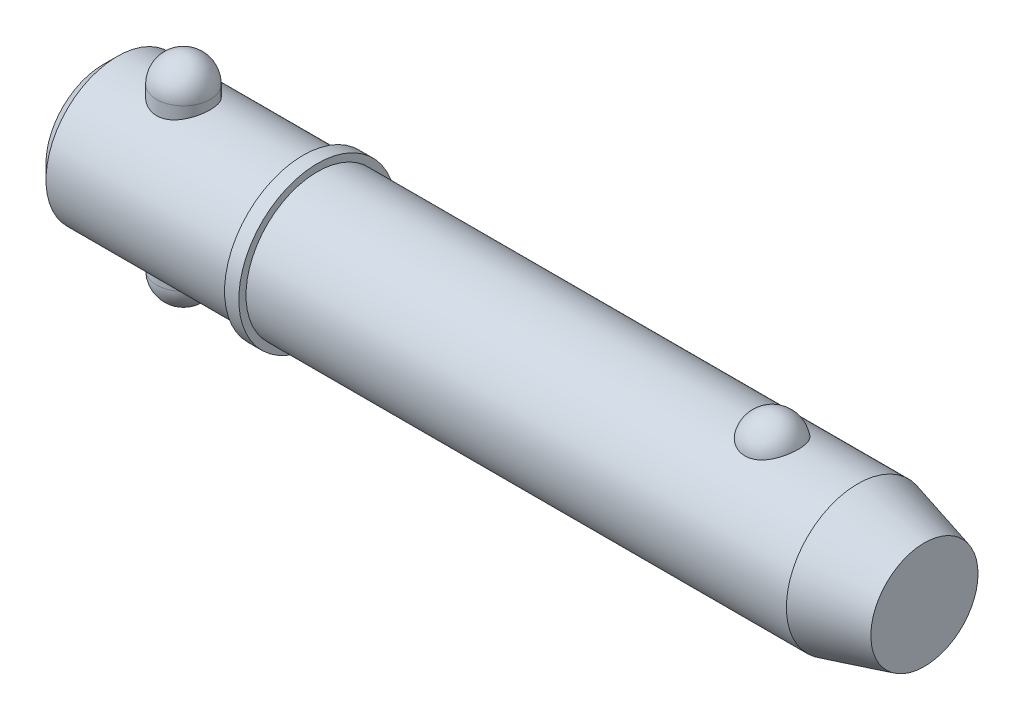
ISO-10303-21;
HEADER;
FILE_DESCRIPTION(('STEP AP214'),'2;1');
FILE_NAME('part.step','',(''),(''),'','','');
FILE_SCHEMA(('AUTOMOTIVE_DESIGN { 1 0 10303 214 1 1 1 1 }'));
ENDSEC;
DATA;
#1=APPLICATION_CONTEXT('core data for automotive mechanical design processes');
#2=APPLICATION_PROTOCOL_DEFINITION('international standard','automotive_design',2000,#1);
#3=PRODUCT_CONTEXT('',#1,'mechanical');
#4=PRODUCT('Part','Part','',(#3));
#5=PRODUCT_RELATED_PRODUCT_CATEGORY('part','',(#4));
#6=PRODUCT_DEFINITION_FORMATION('','',#4);
#7=PRODUCT_DEFINITION_CONTEXT('part definition',#1,'design');
#8=PRODUCT_DEFINITION('design','',#6,#7);
#9=PRODUCT_DEFINITION_SHAPE('','',#8);
#10=(LENGTH_UNIT() NAMED_UNIT(*) SI_UNIT(.MILLI.,.METRE.));
#11=(NAMED_UNIT(*) PLANE_ANGLE_UNIT() SI_UNIT($,.RADIAN.));
#12=(NAMED_UNIT(*) SI_UNIT($,.STERADIAN.) SOLID_ANGLE_UNIT());
#13=UNCERTAINTY_MEASURE_WITH_UNIT(LENGTH_MEASURE(1.E-05),#10,'distance_accuracy_value','');
#14=(GEOMETRIC_REPRESENTATION_CONTEXT(3) GLOBAL_UNCERTAINTY_ASSIGNED_CONTEXT((#13)) GLOBAL_UNIT_ASSIGNED_CONTEXT((#10,
#11,#12)) REPRESENTATION_CONTEXT('',''));
#15=CARTESIAN_POINT('',(0.,0.,0.));
#16=DIRECTION('',(0.,0.,1.));
#17=DIRECTION('',(1.,0.,0.));
#18=AXIS2_PLACEMENT_3D('',#15,#16,#17);
#19=CARTESIAN_POINT('',(14.28,19.05,0.));
#20=DIRECTION('',(0.,-1.,0.));
#21=DIRECTION('',(0.,0.,-1.));
#22=AXIS2_PLACEMENT_3D('',#19,#20,#21);
#23=CYLINDRICAL_SURFACE('',#22,4.76);
#24=CARTESIAN_POINT('',(14.28,-14.29,0.));
#25=DIRECTION('',(0.,-1.,0.));
#26=DIRECTION('',(0.,0.,-1.));
#27=AXIS2_PLACEMENT_3D('',#24,#25,#26);
#28=CIRCLE('',#27,4.76);
#29=CARTESIAN_POINT('',(14.28,-14.29,-4.76));
#30=VERTEX_POINT('',#29);
#31=EDGE_CURVE('P0_E10',#30,#30,#28,.F.);
#32=CARTESIAN_POINT('',(14.28,14.29,0.));
#33=DIRECTION('',(0.,-1.,0.));
#34=DIRECTION('',(0.,0.,-1.));
#35=AXIS2_PLACEMENT_3D('',#32,#33,#34);
#36=CIRCLE('',#35,4.76);
#37=CARTESIAN_POINT('',(14.28,14.29,-4.76));
#38=VERTEX_POINT('',#37);
#39=EDGE_CURVE('P0_E21',#38,#38,#36,.T.);
#40=CARTESIAN_POINT('',(14.28,-14.29,-4.76));
#41=CARTESIAN_POINT('',(14.28,-13.9922916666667,-4.76));
#42=CARTESIAN_POINT('',(14.28,-13.6945833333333,-4.76));
#43=CARTESIAN_POINT('',(14.28,-13.0991666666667,-4.76));
#44=CARTESIAN_POINT('',(14.28,-12.8014583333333,-4.76));
#45=CARTESIAN_POINT('',(14.28,-12.2060416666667,-4.76));
#46=CARTESIAN_POINT('',(14.28,-11.9083333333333,-4.76));
#47=CARTESIAN_POINT('',(14.28,-11.3129166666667,-4.76));
#48=CARTESIAN_POINT('',(14.28,-11.0152083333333,-4.76));
#49=CARTESIAN_POINT('',(14.28,-10.4197916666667,-4.76));
#50=CARTESIAN_POINT('',(14.28,-10.1220833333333,-4.76));
#51=CARTESIAN_POINT('',(14.28,-9.52666666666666,-4.76));
#52=CARTESIAN_POINT('',(14.28,-9.22895833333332,-4.76));
#53=CARTESIAN_POINT('',(14.28,-8.63354166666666,-4.76));
#54=CARTESIAN_POINT('',(14.28,-8.33583333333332,-4.76));
#55=CARTESIAN_POINT('',(14.28,-7.74041666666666,-4.76));
#56=CARTESIAN_POINT('',(14.28,-7.44270833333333,-4.76));
#57=CARTESIAN_POINT('',(14.28,-6.84729166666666,-4.76));
#58=CARTESIAN_POINT('',(14.28,-6.54958333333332,-4.76));
#59=CARTESIAN_POINT('',(14.28,-5.95416666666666,-4.76));
#60=CARTESIAN_POINT('',(14.28,-5.65645833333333,-4.76));
#61=CARTESIAN_POINT('',(14.28,-5.06104166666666,-4.76));
#62=CARTESIAN_POINT('',(14.28,-4.76333333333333,-4.76));
#63=CARTESIAN_POINT('',(14.28,-4.16791666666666,-4.76));
#64=CARTESIAN_POINT('',(14.28,-3.87020833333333,-4.76));
#65=CARTESIAN_POINT('',(14.28,-3.27479166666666,-4.76));
#66=CARTESIAN_POINT('',(14.28,-2.97708333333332,-4.76));
#67=CARTESIAN_POINT('',(14.28,-2.38166666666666,-4.76));
#68=CARTESIAN_POINT('',(14.28,-2.08395833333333,-4.76));
#69=CARTESIAN_POINT('',(14.28,-1.48854166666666,-4.76));
#70=CARTESIAN_POINT('',(14.28,-1.19083333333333,-4.76));
#71=CARTESIAN_POINT('',(14.28,-0.595416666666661,-4.76));
#72=CARTESIAN_POINT('',(14.28,-0.297708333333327,-4.76));
#73=CARTESIAN_POINT('',(14.28,0.297708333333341,-4.76));
#74=CARTESIAN_POINT('',(14.28,0.595416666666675,-4.76));
#75=CARTESIAN_POINT('',(14.28,1.19083333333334,-4.76));
#76=CARTESIAN_POINT('',(14.28,1.48854166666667,-4.76));
#77=CARTESIAN_POINT('',(14.28,2.08395833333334,-4.76));
#78=CARTESIAN_POINT('',(14.28,2.38166666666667,-4.76));
#79=CARTESIAN_POINT('',(14.28,2.97708333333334,-4.76));
#80=CARTESIAN_POINT('',(14.28,3.27479166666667,-4.76));
#81=CARTESIAN_POINT('',(14.28,3.87020833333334,-4.76));
#82=CARTESIAN_POINT('',(14.28,4.16791666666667,-4.76));
#83=CARTESIAN_POINT('',(14.28,4.76333333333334,-4.76));
#84=CARTESIAN_POINT('',(14.28,5.06104166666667,-4.76));
#85=CARTESIAN_POINT('',(14.28,5.65645833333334,-4.76));
#86=CARTESIAN_POINT('',(14.28,5.95416666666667,-4.76));
#87=CARTESIAN_POINT('',(14.28,6.54958333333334,-4.76));
#88=CARTESIAN_POINT('',(14.28,6.84729166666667,-4.76));
#89=CARTESIAN_POINT('',(14.28,7.44270833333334,-4.76));
#90=CARTESIAN_POINT('',(14.28,7.74041666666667,-4.76));
#91=CARTESIAN_POINT('',(14.28,8.33583333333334,-4.76));
#92=CARTESIAN_POINT('',(14.28,8.63354166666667,-4.76));
#93=CARTESIAN_POINT('',(14.28,9.22895833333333,-4.76));
#94=CARTESIAN_POINT('',(14.28,9.52666666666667,-4.76));
#95=CARTESIAN_POINT('',(14.28,10.1220833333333,-4.76));
#96=CARTESIAN_POINT('',(14.28,10.4197916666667,-4.76));
#97=CARTESIAN_POINT('',(14.28,11.0152083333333,-4.76));
#98=CARTESIAN_POINT('',(14.28,11.3129166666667,-4.76));
#99=CARTESIAN_POINT('',(14.28,11.9083333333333,-4.76));
#100=CARTESIAN_POINT('',(14.28,12.2060416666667,-4.76));
#101=CARTESIAN_POINT('',(14.28,12.8014583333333,-4.76));
#102=CARTESIAN_POINT('',(14.28,13.0991666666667,-4.76));
#103=CARTESIAN_POINT('',(14.28,13.6945833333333,-4.76));
#104=CARTESIAN_POINT('',(14.28,13.9922916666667,-4.76));
#105=CARTESIAN_POINT('',(14.28,14.29,-4.76));
#106=B_SPLINE_CURVE_WITH_KNOTS('',3,(#40,#41,#42,#43,#44,#45,#46,#47,#48,#49,#50,#51,#52,#53,
#54,#55,#56,#57,#58,#59,#60,#61,#62,#63,#64,#65,#66,#67,#68,#69,#70,#71,#72,#73,#74,#75,#76,#77,
#78,#79,#80,#81,#82,#83,#84,#85,#86,#87,#88,#89,#90,#91,#92,#93,#94,#95,#96,#97,#98,#99,#100,
#101,#102,#103,#104,#105),.UNSPECIFIED.,.F.,.F.,(4,2,2,2,2,2,2,2,2,2,2,2,2,2,2,2,2,2,2,2,2,2,2,
2,2,2,2,2,2,2,2,2,4),(0.,0.893125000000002,1.78625,2.67937499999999,3.5725,4.465625,5.35875,
6.25187499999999,7.145,8.038125,8.93125,9.82437499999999,10.7175,11.610625,12.50375,13.396875,
14.29,15.183125,16.07625,16.969375,17.8625,18.755625,19.64875,20.541875,21.435,22.328125,
23.22125,24.114375,25.0075,25.900625,26.79375,27.686875,28.58),.UNSPECIFIED.);
#107=EDGE_CURVE('P0_BSEAM14',#30,#38,#106,.T.);
#108=ORIENTED_EDGE('',*,*,#31,.T.);
#109=ORIENTED_EDGE('',*,*,#39,.T.);
#110=ORIENTED_EDGE('',*,*,#107,.T.);
#111=ORIENTED_EDGE('',*,*,#107,.F.);
#112=EDGE_LOOP('',(#108,#110,#109,#111));
#113=FACE_BOUND('',#112,.T.);
#114=ADVANCED_FACE('P0_F14',(#113),#23,.T.);
#115=CARTESIAN_POINT('',(14.28,-14.29,0.));
#116=DIRECTION('',(0.,0.,1.));
#117=DIRECTION('',(1.,0.,0.));
#118=AXIS2_PLACEMENT_3D('',#115,#116,#117);
#119=SPHERICAL_SURFACE('',#118,4.76);
#120=CARTESIAN_POINT('',(14.28,-14.29,0.));
#121=DIRECTION('',(0.,-1.,0.));
#122=DIRECTION('',(0.,0.,-1.));
#123=AXIS2_PLACEMENT_3D('',#120,#121,#122);
#124=SPHERICAL_SURFACE('',#123,4.76);
#125=ORIENTED_EDGE('',*,*,#31,.F.);
#126=EDGE_LOOP('',(#125));
#127=FACE_BOUND('',#126,.T.);
#128=ADVANCED_FACE('P0_F29',(#127),#124,.T.);
#129=CARTESIAN_POINT('',(14.28,14.29,0.));
#130=DIRECTION('',(0.,0.,1.));
#131=DIRECTION('',(1.,0.,0.));
#132=AXIS2_PLACEMENT_3D('',#129,#130,#131);
#133=SPHERICAL_SURFACE('',#132,4.76);
#134=CARTESIAN_POINT('',(14.28,14.29,0.));
#135=DIRECTION('',(0.,-1.,0.));
#136=DIRECTION('',(0.,0.,-1.));
#137=AXIS2_PLACEMENT_3D('',#134,#135,#136);
#138=SPHERICAL_SURFACE('',#137,4.76);
#139=ORIENTED_EDGE('',*,*,#39,.F.);
#140=EDGE_LOOP('',(#139));
#141=FACE_BOUND('',#140,.T.);
#142=ADVANCED_FACE('P0_F16',(#141),#138,.T.);
#143=CLOSED_SHELL('',(#114,#128,#142));
#144=MANIFOLD_SOLID_BREP('P0_B1',#143);
#145=CARTESIAN_POINT('',(0.,0.,0.));
#146=DIRECTION('',(1.,0.,0.));
#147=DIRECTION('',(0.,0.,-1.));
#148=AXIS2_PLACEMENT_3D('',#145,#146,#147);
#149=CYLINDRICAL_SURFACE('',#148,12.7);
#150=CARTESIAN_POINT('',(134.200738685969,0.,0.));
#151=DIRECTION('',(1.,0.,0.));
#152=DIRECTION('',(0.,0.,-1.));
#153=AXIS2_PLACEMENT_3D('',#150,#151,#152);
#154=CIRCLE('',#153,12.7);
#155=CARTESIAN_POINT('',(134.200738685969,0.,-12.7));
#156=VERTEX_POINT('',#155);
#157=EDGE_CURVE('P1_E81',#156,#156,#154,.T.);
#158=ORIENTED_EDGE('',*,*,#157,.F.);
#159=EDGE_LOOP('',(#158));
#160=FACE_BOUND('',#159,.T.);
#161=CARTESIAN_POINT('',(38.1,0.,0.));
#162=DIRECTION('',(1.,0.,0.));
#163=DIRECTION('',(0.,0.,-1.));
#164=AXIS2_PLACEMENT_3D('',#161,#162,#163);
#165=CIRCLE('',#164,12.7);
#166=CARTESIAN_POINT('',(38.1,0.,-12.7));
#167=VERTEX_POINT('',#166);
#168=EDGE_CURVE('P1_E85',#167,#167,#165,.T.);
#169=ORIENTED_EDGE('',*,*,#168,.T.);
#170=EDGE_LOOP('',(#169));
#171=FACE_BOUND('',#170,.T.);
#172=CARTESIAN_POINT('',(118.960042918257,11.7500437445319,4.81938502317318));
#173=CARTESIAN_POINT('',(118.835088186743,11.7500430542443,4.81938571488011));
#174=CARTESIAN_POINT('',(118.710144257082,11.7520975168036,4.81438658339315));
#175=CARTESIAN_POINT('',(118.461142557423,11.760253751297,4.79442904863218));
#176=CARTESIAN_POINT('',(118.337085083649,11.7663568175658,4.77946746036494));
#177=CARTESIAN_POINT('',(118.090901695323,11.7824262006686,4.7397141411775));
#178=CARTESIAN_POINT('',(117.968774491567,11.7923898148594,4.71492928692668));
#179=CARTESIAN_POINT('',(117.727187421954,11.8158938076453,4.65571340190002));
#180=CARTESIAN_POINT('',(117.60772859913,11.8294355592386,4.6212786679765));
#181=CARTESIAN_POINT('',(117.372557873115,11.8596812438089,4.54309502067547));
#182=CARTESIAN_POINT('',(117.256839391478,11.8763792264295,4.49936361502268));
#183=CARTESIAN_POINT('',(117.029653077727,11.9124878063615,4.40287235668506));
#184=CARTESIAN_POINT('',(116.918186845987,11.9318994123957,4.35010914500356));
#185=CARTESIAN_POINT('',(116.591278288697,11.9934256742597,4.17881316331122));
#186=CARTESIAN_POINT('',(116.383127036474,12.038858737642,4.04720756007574));
#187=CARTESIAN_POINT('',(115.985850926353,12.1352173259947,3.748564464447));
#188=CARTESIAN_POINT('',(115.797443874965,12.1862630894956,3.58061821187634));
#189=CARTESIAN_POINT('',(115.450521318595,12.2875163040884,3.21600758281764));
#190=CARTESIAN_POINT('',(115.292011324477,12.3377235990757,3.0193379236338));
#191=CARTESIAN_POINT('',(115.00168878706,12.434492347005,2.592916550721));
#192=CARTESIAN_POINT('',(114.871376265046,12.4807925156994,2.36208286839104));
#193=CARTESIAN_POINT('',(114.649407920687,12.5623454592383,1.88070399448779));
#194=CARTESIAN_POINT('',(114.557755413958,12.5975972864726,1.63015711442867));
#195=CARTESIAN_POINT('',(114.414046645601,12.6538414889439,1.1129886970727));
#196=CARTESIAN_POINT('',(114.362499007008,12.6746503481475,0.846205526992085));
#197=CARTESIAN_POINT('',(114.301977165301,12.699153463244,0.307085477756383));
#198=CARTESIAN_POINT('',(114.293001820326,12.7028481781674,0.0347487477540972));
#199=CARTESIAN_POINT('',(114.317731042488,12.6927785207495,-0.506073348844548));
#200=CARTESIAN_POINT('',(114.351189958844,12.6791146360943,-0.77457186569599));
#201=CARTESIAN_POINT('',(114.459687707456,12.635882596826,-1.30170246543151));
#202=CARTESIAN_POINT('',(114.53472729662,12.606314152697,-1.5603343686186));
#203=CARTESIAN_POINT('',(114.72500006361,12.5342328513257,-2.06083899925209));
#204=CARTESIAN_POINT('',(114.840287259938,12.4917026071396,-2.3026886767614));
#205=CARTESIAN_POINT('',(115.108704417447,12.3981123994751,-2.76259600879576));
#206=CARTESIAN_POINT('',(115.261837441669,12.3470517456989,-2.98065173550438));
#207=CARTESIAN_POINT('',(115.603507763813,12.2416045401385,-3.38786328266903));
#208=CARTESIAN_POINT('',(115.792201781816,12.1872040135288,-3.57688418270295));
#209=CARTESIAN_POINT('',(116.200239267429,12.0814086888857,-3.91941073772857));
#210=CARTESIAN_POINT('',(116.419580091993,12.0300136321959,-4.07291945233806));
#211=CARTESIAN_POINT('',(116.878375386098,11.9373542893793,-4.33691289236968));
#212=CARTESIAN_POINT('',(117.117304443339,11.8958982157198,-4.44824125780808));
#213=CARTESIAN_POINT('',(117.61243761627,11.8268116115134,-4.62881985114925));
#214=CARTESIAN_POINT('',(117.868635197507,11.7991758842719,-4.69808589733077));
#215=CARTESIAN_POINT('',(118.377164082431,11.7622209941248,-4.78983181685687));
#216=CARTESIAN_POINT('',(118.629041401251,11.7520502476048,-4.81449025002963));
#217=CARTESIAN_POINT('',(119.133573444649,11.7485796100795,-4.82295735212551));
#218=CARTESIAN_POINT('',(119.386228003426,11.7552763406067,-4.80677420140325));
#219=CARTESIAN_POINT('',(119.876834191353,11.7842584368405,-4.73525430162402));
#220=CARTESIAN_POINT('',(120.114998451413,11.8060486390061,-4.68116061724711));
#221=CARTESIAN_POINT('',(120.578489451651,11.8622750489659,-4.53678133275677));
#222=CARTESIAN_POINT('',(120.803815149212,11.8967122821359,-4.44649279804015));
#223=CARTESIAN_POINT('',(121.240801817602,11.9754603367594,-4.2298761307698));
#224=CARTESIAN_POINT('',(121.452057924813,12.0199699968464,-4.10280539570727));
#225=CARTESIAN_POINT('',(121.850601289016,12.1138028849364,-3.81685409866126));
#226=CARTESIAN_POINT('',(122.037883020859,12.163127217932,-3.65796622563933));
#227=CARTESIAN_POINT('',(122.393350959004,12.2642343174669,-3.30364864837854));
#228=CARTESIAN_POINT('',(122.560111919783,12.3160165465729,-3.10678783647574));
#229=CARTESIAN_POINT('',(122.859579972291,12.4142566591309,-2.68748409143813));
#230=CARTESIAN_POINT('',(122.992280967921,12.4607135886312,-2.46503658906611));
#231=CARTESIAN_POINT('',(123.224691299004,12.5450236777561,-1.99289519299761));
#232=CARTESIAN_POINT('',(123.323215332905,12.5825557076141,-1.74255918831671));
#233=CARTESIAN_POINT('',(123.479227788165,12.6431720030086,-1.22773734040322));
#234=CARTESIAN_POINT('',(123.536715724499,12.6662560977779,-0.963251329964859));
#235=CARTESIAN_POINT('',(123.609544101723,12.6956486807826,-0.427355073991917));
#236=CARTESIAN_POINT('',(123.624837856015,12.7019385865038,-0.1559374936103));
#237=CARTESIAN_POINT('',(123.612779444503,12.6970201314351,0.385928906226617));
#238=CARTESIAN_POINT('',(123.58542805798,12.6858120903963,0.656377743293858));
#239=CARTESIAN_POINT('',(123.513060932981,12.6568455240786,1.05454017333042));
#240=CARTESIAN_POINT('',(123.483796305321,12.6451962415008,1.18577850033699));
#241=CARTESIAN_POINT('',(123.415022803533,12.6181819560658,1.4451380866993));
#242=CARTESIAN_POINT('',(123.375517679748,12.6028183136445,1.57326046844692));
#243=CARTESIAN_POINT('',(123.286439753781,12.5687547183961,1.82554978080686));
#244=CARTESIAN_POINT('',(123.236862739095,12.5500533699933,1.9497150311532));
#245=CARTESIAN_POINT('',(123.12792115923,12.5098093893,2.1931437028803));
#246=CARTESIAN_POINT('',(123.068560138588,12.4882677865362,2.31240887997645));
#247=CARTESIAN_POINT('',(122.93997128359,12.4427679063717,2.54593031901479));
#248=CARTESIAN_POINT('',(122.870688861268,12.4187964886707,2.66015396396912));
#249=CARTESIAN_POINT('',(122.722903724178,12.3691892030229,2.88202659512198));
#250=CARTESIAN_POINT('',(122.644404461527,12.3435539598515,2.98967802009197));
#251=CARTESIAN_POINT('',(122.478550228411,12.2912955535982,3.19774385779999));
#252=CARTESIAN_POINT('',(122.391191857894,12.2646720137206,3.29815546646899));
#253=CARTESIAN_POINT('',(122.208161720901,12.2111945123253,3.49095035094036));
#254=CARTESIAN_POINT('',(122.112493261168,12.1843406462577,3.58333679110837));
#255=CARTESIAN_POINT('',(121.913627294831,12.1312249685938,3.75922876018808));
#256=CARTESIAN_POINT('',(121.810450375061,12.104961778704,3.84275713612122));
#257=CARTESIAN_POINT('',(121.59701336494,12.0537284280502,4.00056406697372));
#258=CARTESIAN_POINT('',(121.486756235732,12.028757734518,4.07484645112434));
#259=CARTESIAN_POINT('',(121.259755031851,11.9808306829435,4.21367959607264));
#260=CARTESIAN_POINT('',(121.143006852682,11.9578756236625,4.27822410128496));
#261=CARTESIAN_POINT('',(120.90394258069,11.9147184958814,4.39698483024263));
#262=CARTESIAN_POINT('',(120.781628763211,11.894515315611,4.45120522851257));
#263=CARTESIAN_POINT('',(120.522952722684,11.8561129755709,4.55255353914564));
#264=CARTESIAN_POINT('',(120.386223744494,11.8381764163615,4.59884858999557));
#265=CARTESIAN_POINT('',(120.108608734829,11.8069093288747,4.67853897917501));
#266=CARTESIAN_POINT('',(119.967724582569,11.7935767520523,4.71194005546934));
#267=CARTESIAN_POINT('',(119.68309446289,11.7720277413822,4.76552188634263));
#268=CARTESIAN_POINT('',(119.539348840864,11.7638106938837,4.78570422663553));
#269=CARTESIAN_POINT('',(119.250411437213,11.7528195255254,4.81263433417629));
#270=CARTESIAN_POINT('',(119.105219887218,11.7500445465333,4.81938421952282));
#271=CARTESIAN_POINT('',(118.960042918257,11.7500437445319,4.81938502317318));
#272=B_SPLINE_CURVE_WITH_KNOTS('',3,(#172,#173,#174,#175,#176,#177,#178,#179,#180,#181,#182,
#183,#184,#185,#186,#187,#188,#189,#190,#191,#192,#193,#194,#195,#196,#197,#198,#199,#200,#201,
#202,#203,#204,#205,#206,#207,#208,#209,#210,#211,#212,#213,#214,#215,#216,#217,#218,#219,#220,
#221,#222,#223,#224,#225,#226,#227,#228,#229,#230,#231,#232,#233,#234,#235,#236,#237,#238,#239,
#240,#241,#242,#243,#244,#245,#246,#247,#248,#249,#250,#251,#252,#253,#254,#255,#256,#257,#258,
#259,#260,#261,#262,#263,#264,#265,#266,#267,#268,#269,#270,#271),.UNSPECIFIED.,.T.,.F.,(4,2,2,
2,2,2,2,2,2,2,2,2,2,2,2,2,2,2,2,2,2,2,2,2,2,2,2,2,2,2,2,2,2,2,2,2,2,2,2,2,2,2,2,2,2,2,2,2,2,4),
(0.,0.374729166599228,0.749578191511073,1.12416526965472,1.49889629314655,1.87292776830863,
2.24709865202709,2.99481328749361,3.76399449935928,4.53331735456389,5.3368391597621,
6.14042986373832,6.95405296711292,7.76765424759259,8.57656703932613,9.38549455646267,
10.1955119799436,11.0055949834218,11.8193353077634,12.6330054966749,13.4294141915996,
14.2255231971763,14.9815786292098,15.7374826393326,16.4696948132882,17.2019663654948,
17.9501979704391,18.6986017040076,19.484470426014,20.2704797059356,21.0815215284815,
21.8925729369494,22.7045213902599,23.5164550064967,23.9209608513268,24.3253187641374,
24.7298461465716,25.1342272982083,25.54092555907,25.9474719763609,26.3541750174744,
26.7607169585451,27.1661834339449,27.5714814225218,27.9770386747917,28.3824315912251,
28.8181206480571,29.2536155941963,29.6890582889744,30.1244323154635),.UNSPECIFIED.);
#273=CARTESIAN_POINT('',(118.960042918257,11.7500437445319,4.81938502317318));
#274=VERTEX_POINT('',#273);
#275=EDGE_CURVE('P1_E35',#274,#274,#272,.T.);
#276=ORIENTED_EDGE('',*,*,#275,.T.);
#277=EDGE_LOOP('',(#276));
#278=FACE_BOUND('',#277,.T.);
#279=ADVANCED_FACE('P1_F13',(#160,#171,#278),#149,.T.);
#280=CARTESIAN_POINT('',(0.,0.,0.));
#281=DIRECTION('',(-1.,0.,0.));
#282=DIRECTION('',(0.,0.,1.));
#283=AXIS2_PLACEMENT_3D('',#280,#281,#282);
#284=PLANE('',#283);
#285=CARTESIAN_POINT('',(0.,0.,0.));
#286=DIRECTION('',(1.,0.,0.));
#287=DIRECTION('',(0.,0.,-1.));
#288=AXIS2_PLACEMENT_3D('',#285,#286,#287);
#289=CIRCLE('',#288,10.16);
#290=CARTESIAN_POINT('',(0.,0.,-10.16));
#291=VERTEX_POINT('',#290);
#292=EDGE_CURVE('P1_E9',#291,#291,#289,.T.);
#293=ORIENTED_EDGE('',*,*,#292,.F.);
#294=EDGE_LOOP('',(#293));
#295=FACE_BOUND('',#294,.T.);
#296=ADVANCED_FACE('P1_F15',(#295),#284,.T.);
#297=CARTESIAN_POINT('',(2.53999999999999,0.,0.));
#298=DIRECTION('',(1.,0.,0.));
#299=DIRECTION('',(0.,0.,-1.));
#300=AXIS2_PLACEMENT_3D('',#297,#298,#299);
#301=CONICAL_SURFACE('',#300,12.7,0.78539816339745);
#302=ORIENTED_EDGE('',*,*,#292,.T.);
#303=EDGE_LOOP('',(#302));
#304=FACE_BOUND('',#303,.T.);
#305=CARTESIAN_POINT('',(2.53999999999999,0.,0.));
#306=DIRECTION('',(1.,0.,0.));
#307=DIRECTION('',(0.,0.,-1.));
#308=AXIS2_PLACEMENT_3D('',#305,#306,#307);
#309=CIRCLE('',#308,12.7);
#310=CARTESIAN_POINT('',(2.53999999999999,0.,-12.7));
#311=VERTEX_POINT('',#310);
#312=EDGE_CURVE('P1_E26',#311,#311,#309,.T.);
#313=ORIENTED_EDGE('',*,*,#312,.F.);
#314=EDGE_LOOP('',(#313));
#315=FACE_BOUND('',#314,.T.);
#316=ADVANCED_FACE('P1_F77',(#304,#315),#301,.T.);
#317=CARTESIAN_POINT('',(0.,0.,0.));
#318=DIRECTION('',(1.,0.,0.));
#319=DIRECTION('',(0.,0.,-1.));
#320=AXIS2_PLACEMENT_3D('',#317,#318,#319);
#321=CYLINDRICAL_SURFACE('',#320,12.7);
#322=CARTESIAN_POINT('',(14.28,-11.7742260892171,4.76));
#323=CARTESIAN_POINT('',(14.1514948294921,-11.7742255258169,4.76000061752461));
#324=CARTESIAN_POINT('',(14.0229980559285,-11.7763355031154,4.75479194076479));
#325=CARTESIAN_POINT('',(13.7669369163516,-11.7847043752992,4.73401198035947));
#326=CARTESIAN_POINT('',(13.6393728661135,-11.7909646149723,4.71843733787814));
#327=CARTESIAN_POINT('',(13.386226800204,-11.8074248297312,4.67709434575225));
#328=CARTESIAN_POINT('',(13.2606439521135,-11.8176231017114,4.65133040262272));
#329=CARTESIAN_POINT('',(13.0122434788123,-11.8416347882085,4.58985545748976));
#330=CARTESIAN_POINT('',(12.8894269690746,-11.8554496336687,4.55414051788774));
#331=CARTESIAN_POINT('',(12.6477622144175,-11.8862222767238,4.47320764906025));
#332=CARTESIAN_POINT('',(12.5289037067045,-11.9031710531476,4.4280169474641));
#333=CARTESIAN_POINT('',(12.2955059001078,-11.939736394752,4.32845291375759));
#334=CARTESIAN_POINT('',(12.1809682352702,-11.9593539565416,4.2740761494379));
#335=CARTESIAN_POINT('',(11.8448901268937,-12.0213893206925,4.09777237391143));
#336=CARTESIAN_POINT('',(11.6307077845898,-12.0670135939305,3.9626122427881));
#337=CARTESIAN_POINT('',(11.2179129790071,-12.1641514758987,3.65386230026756));
#338=CARTESIAN_POINT('',(11.0204399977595,-12.2158379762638,3.47881300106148));
#339=CARTESIAN_POINT('',(10.6568212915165,-12.3178468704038,3.09829182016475));
#340=CARTESIAN_POINT('',(10.4906822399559,-12.3681689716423,2.89281347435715));
#341=CARTESIAN_POINT('',(10.1890299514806,-12.4638367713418,2.44867909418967));
#342=CARTESIAN_POINT('',(10.054749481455,-12.5089552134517,2.20913281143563));
#343=CARTESIAN_POINT('',(9.82886079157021,-12.5870472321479,1.70885919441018));
#344=CARTESIAN_POINT('',(9.73723778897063,-12.620025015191,1.44813923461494));
#345=CARTESIAN_POINT('',(9.60324488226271,-12.6688874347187,0.9248423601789));
#346=CARTESIAN_POINT('',(9.55892269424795,-12.6854474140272,0.662829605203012));
#347=CARTESIAN_POINT('',(9.5145335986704,-12.7020320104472,0.134596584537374));
#348=CARTESIAN_POINT('',(9.5144523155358,-12.7020619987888,-0.131622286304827));
#349=CARTESIAN_POINT('',(9.55741019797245,-12.6860129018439,-0.646717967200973));
#350=CARTESIAN_POINT('',(9.59831845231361,-12.6707298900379,-0.895801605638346));
#351=CARTESIAN_POINT('',(9.71850987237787,-12.6268158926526,-1.38327219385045));
#352=CARTESIAN_POINT('',(9.79779575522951,-12.5981839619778,-1.62165838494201));
#353=CARTESIAN_POINT('',(9.99348296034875,-12.5298894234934,-2.08508424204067));
#354=CARTESIAN_POINT('',(10.110407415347,-12.4900724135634,-2.30987931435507));
#355=CARTESIAN_POINT('',(10.3775896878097,-12.4034373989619,-2.7372158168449));
#356=CARTESIAN_POINT('',(10.5278582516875,-12.3566171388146,-2.93975004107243));
#357=CARTESIAN_POINT('',(10.8677318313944,-12.257571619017,-3.32936830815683));
#358=CARTESIAN_POINT('',(11.0591227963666,-12.2051903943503,-3.51485714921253));
#359=CARTESIAN_POINT('',(11.4706087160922,-12.1031155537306,-3.85170663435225));
#360=CARTESIAN_POINT('',(11.6907108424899,-12.0534226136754,-4.00305872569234));
#361=CARTESIAN_POINT('',(12.1596597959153,-11.9613684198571,-4.27038218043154));
#362=CARTESIAN_POINT('',(12.4090353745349,-11.9191939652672,-4.38549550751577));
#363=CARTESIAN_POINT('',(12.9256290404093,-11.8491124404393,-4.57149117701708));
#364=CARTESIAN_POINT('',(13.1928371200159,-11.8211974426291,-4.64239810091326));
#365=CARTESIAN_POINT('',(13.7217488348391,-11.7846654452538,-4.73434137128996));
#366=CARTESIAN_POINT('',(13.9829438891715,-11.7750694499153,-4.75791141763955));
#367=CARTESIAN_POINT('',(14.5056760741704,-11.7734909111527,-4.76182097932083));
#368=CARTESIAN_POINT('',(14.7672131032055,-11.7815039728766,-4.74217128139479));
#369=CARTESIAN_POINT('',(15.2702140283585,-11.8132466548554,-4.66249544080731));
#370=CARTESIAN_POINT('',(15.5120417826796,-11.8362133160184,-4.60442726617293));
#371=CARTESIAN_POINT('',(15.9824097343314,-11.8943704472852,-4.45202868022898));
#372=CARTESIAN_POINT('',(16.2109472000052,-11.9295634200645,-4.35769084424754));
#373=CARTESIAN_POINT('',(16.6577741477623,-12.0098310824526,-4.13144368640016));
#374=CARTESIAN_POINT('',(16.8753590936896,-12.055226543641,-3.99825937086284));
#375=CARTESIAN_POINT('',(17.2859732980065,-12.150238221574,-3.69949845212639));
#376=CARTESIAN_POINT('',(17.4789935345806,-12.19985597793,-3.5339100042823));
#377=CARTESIAN_POINT('',(17.8477707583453,-12.3015434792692,-3.1624728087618));
#378=CARTESIAN_POINT('',(18.0216609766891,-12.3535695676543,-2.95473880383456));
#379=CARTESIAN_POINT('',(18.254545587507,-12.426745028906,-2.62277433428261));
#380=CARTESIAN_POINT('',(18.3275489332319,-12.4503382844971,-2.50865480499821));
#381=CARTESIAN_POINT('',(18.463723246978,-12.4952713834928,-2.27428971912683));
#382=CARTESIAN_POINT('',(18.5268984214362,-12.5166121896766,-2.15404681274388));
#383=CARTESIAN_POINT('',(18.6427140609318,-12.5563817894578,-1.90858448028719));
#384=CARTESIAN_POINT('',(18.6953855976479,-12.5748191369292,-1.78338108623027));
#385=CARTESIAN_POINT('',(18.7899337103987,-12.6083284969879,-1.52857834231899));
#386=CARTESIAN_POINT('',(18.8318147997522,-12.6234019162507,-1.39898085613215));
#387=CARTESIAN_POINT('',(18.9043819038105,-12.6497495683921,-1.13633254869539));
#388=CARTESIAN_POINT('',(18.9350698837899,-12.6610244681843,-1.00328233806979));
#389=CARTESIAN_POINT('',(18.9849303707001,-12.6794412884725,-0.734761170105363));
#390=CARTESIAN_POINT('',(19.0041035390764,-12.6865834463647,-0.59929035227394));
#391=CARTESIAN_POINT('',(19.0299427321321,-12.6962286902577,-0.335006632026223));
#392=CARTESIAN_POINT('',(19.0372742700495,-12.698978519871,-0.206267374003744));
#393=CARTESIAN_POINT('',(19.0414668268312,-12.7005496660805,0.0514515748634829));
#394=CARTESIAN_POINT('',(19.038324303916,-12.69936965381,0.180431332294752));
#395=CARTESIAN_POINT('',(19.0215965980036,-12.6931114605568,0.437551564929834));
#396=CARTESIAN_POINT('',(19.0080165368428,-12.6880351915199,0.565692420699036));
#397=CARTESIAN_POINT('',(18.9705519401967,-12.6741222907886,0.820297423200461));
#398=CARTESIAN_POINT('',(18.9466635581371,-12.665284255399,0.946760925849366));
#399=CARTESIAN_POINT('',(18.8895279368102,-12.6443449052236,1.19395899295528));
#400=CARTESIAN_POINT('',(18.8565273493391,-12.6323299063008,1.3147578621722));
#401=CARTESIAN_POINT('',(18.781239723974,-12.6052503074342,1.55308888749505));
#402=CARTESIAN_POINT('',(18.738949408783,-12.5901846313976,1.67061987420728));
#403=CARTESIAN_POINT('',(18.5986461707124,-12.5409473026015,2.01714406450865));
#404=CARTESIAN_POINT('',(18.4871532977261,-12.502717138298,2.24027279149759));
#405=CARTESIAN_POINT('',(18.2262440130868,-12.4173042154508,2.6742599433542));
#406=CARTESIAN_POINT('',(18.0754310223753,-12.3698127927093,2.88420891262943));
#407=CARTESIAN_POINT('',(17.7421836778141,-12.271667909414,3.27675114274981));
#408=CARTESIAN_POINT('',(17.5597380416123,-12.2210133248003,3.45933459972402));
#409=CARTESIAN_POINT('',(17.2605468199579,-12.1452079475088,3.7138066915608));
#410=CARTESIAN_POINT('',(17.1535518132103,-12.119328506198,3.79719993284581));
#411=CARTESIAN_POINT('',(16.9326449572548,-12.0688597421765,3.95467398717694));
#412=CARTESIAN_POINT('',(16.8187356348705,-12.0442699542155,4.02875817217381));
#413=CARTESIAN_POINT('',(16.5846234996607,-11.9971053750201,4.16711104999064));
#414=CARTESIAN_POINT('',(16.4644172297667,-11.9745317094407,4.23137427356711));
#415=CARTESIAN_POINT('',(16.2185866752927,-11.9321360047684,4.34949041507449));
#416=CARTESIAN_POINT('',(16.09296473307,-11.9123127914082,4.40334777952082));
#417=CARTESIAN_POINT('',(15.8314769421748,-11.875268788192,4.50232278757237));
#418=CARTESIAN_POINT('',(15.6954035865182,-11.8582009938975,4.54695127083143));
#419=CARTESIAN_POINT('',(15.4194002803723,-11.8284328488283,4.62383807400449));
#420=CARTESIAN_POINT('',(15.2794720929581,-11.815730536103,4.6561019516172));
#421=CARTESIAN_POINT('',(14.9969657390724,-11.7951940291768,4.70788444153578));
#422=CARTESIAN_POINT('',(14.8543884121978,-11.7873583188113,4.72740702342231));
#423=CARTESIAN_POINT('',(14.5678704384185,-11.7768749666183,4.75346370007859));
#424=CARTESIAN_POINT('',(14.4239299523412,-11.7742267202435,4.75999930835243));
#425=CARTESIAN_POINT('',(14.28,-11.7742260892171,4.76));
#426=B_SPLINE_CURVE_WITH_KNOTS('',3,(#322,#323,#324,#325,#326,#327,#328,#329,#330,#331,#332,
#333,#334,#335,#336,#337,#338,#339,#340,#341,#342,#343,#344,#345,#346,#347,#348,#349,#350,#351,
#352,#353,#354,#355,#356,#357,#358,#359,#360,#361,#362,#363,#364,#365,#366,#367,#368,#369,#370,
#371,#372,#373,#374,#375,#376,#377,#378,#379,#380,#381,#382,#383,#384,#385,#386,#387,#388,#389,
#390,#391,#392,#393,#394,#395,#396,#397,#398,#399,#400,#401,#402,#403,#404,#405,#406,#407,#408,
#409,#410,#411,#412,#413,#414,#415,#416,#417,#418,#419,#420,#421,#422,#423,#424,#425),
.UNSPECIFIED.,.T.,.F.,(4,2,2,2,2,2,2,2,2,2,2,2,2,2,2,2,2,2,2,2,2,2,2,2,2,2,2,2,2,2,2,2,2,2,2,2,
2,2,2,2,2,2,2,2,2,2,2,2,2,2,2,4),(0.,0.385378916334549,0.770882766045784,1.15622008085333,
1.54171009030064,1.92610725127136,2.31064835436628,3.07917291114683,3.88239385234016,
4.68578566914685,5.51648193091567,6.34689010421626,7.14151420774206,7.93588010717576,
8.69098665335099,9.44614666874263,10.2122918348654,10.9786842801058,11.789876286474,
12.6012713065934,13.4306405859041,14.2595482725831,15.0427613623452,15.8257790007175,
16.5716820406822,17.3177378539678,18.0917395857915,18.8660247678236,19.6893332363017,
20.1014571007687,20.5134040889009,20.9241137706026,21.3346513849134,21.7451168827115,
22.1555587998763,22.542011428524,22.928594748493,23.3149884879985,23.7015265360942,
24.0784835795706,24.4555738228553,25.2091300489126,25.994347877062,26.7798463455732,
27.1937428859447,27.6074890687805,28.0214648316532,28.4352633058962,28.8672794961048,
29.299101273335,29.7307884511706,30.1624253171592),.UNSPECIFIED.);
#427=CARTESIAN_POINT('',(14.28,-11.7742260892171,4.76));
#428=VERTEX_POINT('',#427);
#429=EDGE_CURVE('P1_E17',#428,#428,#426,.T.);
#430=ORIENTED_EDGE('',*,*,#429,.F.);
#431=EDGE_LOOP('',(#430));
#432=FACE_BOUND('',#431,.T.);
#433=CARTESIAN_POINT('',(14.28,11.7742260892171,4.76));
#434=CARTESIAN_POINT('',(14.4085051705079,11.7742255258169,4.76000061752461));
#435=CARTESIAN_POINT('',(14.5370019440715,11.7763355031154,4.75479194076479));
#436=CARTESIAN_POINT('',(14.7930630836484,11.7847043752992,4.73401198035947));
#437=CARTESIAN_POINT('',(14.9206271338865,11.7909646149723,4.71843733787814));
#438=CARTESIAN_POINT('',(15.173773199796,11.8074248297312,4.67709434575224));
#439=CARTESIAN_POINT('',(15.2993560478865,11.8176231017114,4.65133040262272));
#440=CARTESIAN_POINT('',(15.5477565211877,11.8416347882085,4.58985545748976));
#441=CARTESIAN_POINT('',(15.6705730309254,11.8554496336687,4.55414051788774));
#442=CARTESIAN_POINT('',(15.9122377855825,11.8862222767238,4.47320764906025));
#443=CARTESIAN_POINT('',(16.0310962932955,11.9031710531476,4.4280169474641));
#444=CARTESIAN_POINT('',(16.2644940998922,11.939736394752,4.32845291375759));
#445=CARTESIAN_POINT('',(16.3790317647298,11.9593539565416,4.2740761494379));
#446=CARTESIAN_POINT('',(16.7151098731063,12.0213893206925,4.09777237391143));
#447=CARTESIAN_POINT('',(16.9292922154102,12.0670135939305,3.96261224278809));
#448=CARTESIAN_POINT('',(17.3420870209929,12.1641514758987,3.65386230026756));
#449=CARTESIAN_POINT('',(17.5395600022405,12.2158379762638,3.47881300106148));
#450=CARTESIAN_POINT('',(17.9031787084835,12.3178468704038,3.09829182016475));
#451=CARTESIAN_POINT('',(18.0693177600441,12.3681689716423,2.89281347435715));
#452=CARTESIAN_POINT('',(18.3709700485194,12.4638367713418,2.44867909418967));
#453=CARTESIAN_POINT('',(18.505250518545,12.5089552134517,2.20913281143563));
#454=CARTESIAN_POINT('',(18.7311392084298,12.5870472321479,1.70885919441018));
#455=CARTESIAN_POINT('',(18.8227622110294,12.620025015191,1.44813923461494));
#456=CARTESIAN_POINT('',(18.9567551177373,12.6688874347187,0.924842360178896));
#457=CARTESIAN_POINT('',(19.0010773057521,12.6854474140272,0.662829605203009));
#458=CARTESIAN_POINT('',(19.0454664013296,12.7020320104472,0.134596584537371));
#459=CARTESIAN_POINT('',(19.0455476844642,12.7020619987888,-0.13162228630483));
#460=CARTESIAN_POINT('',(19.0025898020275,12.6860129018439,-0.646717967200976));
#461=CARTESIAN_POINT('',(18.9616815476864,12.6707298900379,-0.89580160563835));
#462=CARTESIAN_POINT('',(18.8414901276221,12.6268158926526,-1.38327219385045));
#463=CARTESIAN_POINT('',(18.7622042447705,12.5981839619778,-1.62165838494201));
#464=CARTESIAN_POINT('',(18.5665170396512,12.5298894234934,-2.08508424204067));
#465=CARTESIAN_POINT('',(18.449592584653,12.4900724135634,-2.30987931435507));
#466=CARTESIAN_POINT('',(18.1824103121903,12.4034373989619,-2.7372158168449));
#467=CARTESIAN_POINT('',(18.0321417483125,12.3566171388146,-2.93975004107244));
#468=CARTESIAN_POINT('',(17.6922681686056,12.257571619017,-3.32936830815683));
#469=CARTESIAN_POINT('',(17.5008772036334,12.2051903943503,-3.51485714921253));
#470=CARTESIAN_POINT('',(17.0893912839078,12.1031155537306,-3.85170663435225));
#471=CARTESIAN_POINT('',(16.8692891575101,12.0534226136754,-4.00305872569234));
#472=CARTESIAN_POINT('',(16.4003402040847,11.9613684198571,-4.27038218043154));
#473=CARTESIAN_POINT('',(16.1509646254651,11.9191939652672,-4.38549550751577));
#474=CARTESIAN_POINT('',(15.6343709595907,11.8491124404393,-4.57149117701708));
#475=CARTESIAN_POINT('',(15.367162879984,11.8211974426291,-4.64239810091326));
#476=CARTESIAN_POINT('',(14.8382511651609,11.7846654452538,-4.73434137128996));
#477=CARTESIAN_POINT('',(14.5770561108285,11.7750694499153,-4.75791141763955));
#478=CARTESIAN_POINT('',(14.0543239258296,11.7734909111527,-4.76182097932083));
#479=CARTESIAN_POINT('',(13.7927868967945,11.7815039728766,-4.74217128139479));
#480=CARTESIAN_POINT('',(13.2897859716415,11.8132466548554,-4.66249544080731));
#481=CARTESIAN_POINT('',(13.0479582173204,11.8362133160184,-4.60442726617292));
#482=CARTESIAN_POINT('',(12.5775902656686,11.8943704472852,-4.45202868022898));
#483=CARTESIAN_POINT('',(12.3490527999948,11.9295634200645,-4.35769084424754));
#484=CARTESIAN_POINT('',(11.9022258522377,12.0098310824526,-4.13144368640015));
#485=CARTESIAN_POINT('',(11.6846409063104,12.055226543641,-3.99825937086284));
#486=CARTESIAN_POINT('',(11.2740267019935,12.150238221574,-3.69949845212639));
#487=CARTESIAN_POINT('',(11.0810064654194,12.19985597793,-3.5339100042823));
#488=CARTESIAN_POINT('',(10.7122292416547,12.3015434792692,-3.1624728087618));
#489=CARTESIAN_POINT('',(10.5383390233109,12.3535695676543,-2.95473880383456));
#490=CARTESIAN_POINT('',(10.305454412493,12.426745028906,-2.6227743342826));
#491=CARTESIAN_POINT('',(10.2324510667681,12.4503382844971,-2.50865480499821));
#492=CARTESIAN_POINT('',(10.096276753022,12.4952713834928,-2.27428971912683));
#493=CARTESIAN_POINT('',(10.0331015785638,12.5166121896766,-2.15404681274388));
#494=CARTESIAN_POINT('',(9.91728593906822,12.5563817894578,-1.90858448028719));
#495=CARTESIAN_POINT('',(9.8646144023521,12.5748191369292,-1.78338108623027));
#496=CARTESIAN_POINT('',(9.77006628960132,12.6083284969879,-1.52857834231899));
#497=CARTESIAN_POINT('',(9.72818520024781,12.6234019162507,-1.39898085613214));
#498=CARTESIAN_POINT('',(9.65561809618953,12.6497495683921,-1.13633254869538));
#499=CARTESIAN_POINT('',(9.62493011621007,12.6610244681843,-1.00328233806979));
#500=CARTESIAN_POINT('',(9.57506962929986,12.6794412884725,-0.734761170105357));
#501=CARTESIAN_POINT('',(9.55589646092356,12.6865834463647,-0.599290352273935));
#502=CARTESIAN_POINT('',(9.53005726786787,12.6962286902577,-0.335006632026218));
#503=CARTESIAN_POINT('',(9.52272572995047,12.698978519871,-0.20626737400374));
#504=CARTESIAN_POINT('',(9.51853317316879,12.7005496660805,0.0514515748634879));
#505=CARTESIAN_POINT('',(9.52167569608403,12.69936965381,0.180431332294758));
#506=CARTESIAN_POINT('',(9.53840340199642,12.6931114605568,0.43755156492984));
#507=CARTESIAN_POINT('',(9.55198346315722,12.6880351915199,0.565692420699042));
#508=CARTESIAN_POINT('',(9.58944805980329,12.6741222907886,0.820297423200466));
#509=CARTESIAN_POINT('',(9.61333644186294,12.665284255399,0.946760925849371));
#510=CARTESIAN_POINT('',(9.67047206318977,12.6443449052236,1.19395899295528));
#511=CARTESIAN_POINT('',(9.7034726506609,12.6323299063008,1.31475786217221));
#512=CARTESIAN_POINT('',(9.77876027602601,12.6052503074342,1.55308888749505));
#513=CARTESIAN_POINT('',(9.82105059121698,12.5901846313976,1.67061987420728));
#514=CARTESIAN_POINT('',(9.96135382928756,12.5409473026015,2.01714406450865));
#515=CARTESIAN_POINT('',(10.0728467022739,12.502717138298,2.24027279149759));
#516=CARTESIAN_POINT('',(10.3337559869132,12.4173042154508,2.6742599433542));
#517=CARTESIAN_POINT('',(10.4845689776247,12.3698127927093,2.88420891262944));
#518=CARTESIAN_POINT('',(10.8178163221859,12.271667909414,3.27675114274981));
#519=CARTESIAN_POINT('',(11.0002619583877,12.2210133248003,3.45933459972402));
#520=CARTESIAN_POINT('',(11.2994531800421,12.1452079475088,3.7138066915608));
#521=CARTESIAN_POINT('',(11.4064481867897,12.119328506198,3.79719993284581));
#522=CARTESIAN_POINT('',(11.6273550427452,12.0688597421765,3.95467398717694));
#523=CARTESIAN_POINT('',(11.7412643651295,12.0442699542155,4.02875817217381));
#524=CARTESIAN_POINT('',(11.9753765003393,11.9971053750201,4.16711104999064));
#525=CARTESIAN_POINT('',(12.0955827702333,11.9745317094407,4.23137427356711));
#526=CARTESIAN_POINT('',(12.3414133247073,11.9321360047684,4.34949041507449));
#527=CARTESIAN_POINT('',(12.46703526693,11.9123127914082,4.40334777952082));
#528=CARTESIAN_POINT('',(12.7285230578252,11.875268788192,4.50232278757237));
#529=CARTESIAN_POINT('',(12.8645964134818,11.8582009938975,4.54695127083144));
#530=CARTESIAN_POINT('',(13.1405997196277,11.8284328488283,4.62383807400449));
#531=CARTESIAN_POINT('',(13.2805279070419,11.815730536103,4.6561019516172));
#532=CARTESIAN_POINT('',(13.5630342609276,11.7951940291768,4.70788444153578));
#533=CARTESIAN_POINT('',(13.7056115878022,11.7873583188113,4.72740702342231));
#534=CARTESIAN_POINT('',(13.9921295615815,11.7768749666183,4.75346370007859));
#535=CARTESIAN_POINT('',(14.1360700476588,11.7742267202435,4.75999930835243));
#536=CARTESIAN_POINT('',(14.28,11.7742260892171,4.76));
#537=B_SPLINE_CURVE_WITH_KNOTS('',3,(#433,#434,#435,#436,#437,#438,#439,#440,#441,#442,#443,
#444,#445,#446,#447,#448,#449,#450,#451,#452,#453,#454,#455,#456,#457,#458,#459,#460,#461,#462,
#463,#464,#465,#466,#467,#468,#469,#470,#471,#472,#473,#474,#475,#476,#477,#478,#479,#480,#481,
#482,#483,#484,#485,#486,#487,#488,#489,#490,#491,#492,#493,#494,#495,#496,#497,#498,#499,#500,
#501,#502,#503,#504,#505,#506,#507,#508,#509,#510,#511,#512,#513,#514,#515,#516,#517,#518,#519,
#520,#521,#522,#523,#524,#525,#526,#527,#528,#529,#530,#531,#532,#533,#534,#535,#536),
.UNSPECIFIED.,.T.,.F.,(4,2,2,2,2,2,2,2,2,2,2,2,2,2,2,2,2,2,2,2,2,2,2,2,2,2,2,2,2,2,2,2,2,2,2,2,
2,2,2,2,2,2,2,2,2,2,2,2,2,2,2,4),(0.,0.385378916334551,0.770882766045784,1.15622008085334,
1.54171009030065,1.92610725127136,2.31064835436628,3.07917291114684,3.88239385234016,
4.68578566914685,5.51648193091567,6.34689010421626,7.14151420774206,7.93588010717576,
8.690986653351,9.44614666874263,10.2122918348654,10.9786842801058,11.789876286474,
12.6012713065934,13.4306405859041,14.2595482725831,15.0427613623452,15.8257790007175,
16.5716820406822,17.3177378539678,18.0917395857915,18.8660247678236,19.6893332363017,
20.1014571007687,20.5134040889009,20.9241137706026,21.3346513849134,21.7451168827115,
22.1555587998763,22.542011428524,22.928594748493,23.3149884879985,23.7015265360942,
24.0784835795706,24.4555738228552,25.2091300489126,25.994347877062,26.7798463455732,
27.1937428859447,27.6074890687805,28.0214648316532,28.4352633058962,28.8672794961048,
29.299101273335,29.7307884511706,30.1624253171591),.UNSPECIFIED.);
#538=CARTESIAN_POINT('',(14.28,11.7742260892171,4.76));
#539=VERTEX_POINT('',#538);
#540=EDGE_CURVE('P1_E43',#539,#539,#537,.T.);
#541=ORIENTED_EDGE('',*,*,#540,.F.);
#542=EDGE_LOOP('',(#541));
#543=FACE_BOUND('',#542,.T.);
#544=ORIENTED_EDGE('',*,*,#312,.T.);
#545=EDGE_LOOP('',(#544));
#546=FACE_BOUND('',#545,.T.);
#547=CARTESIAN_POINT('',(35.56,0.,0.));
#548=DIRECTION('',(1.,0.,0.));
#549=DIRECTION('',(0.,0.,-1.));
#550=AXIS2_PLACEMENT_3D('',#547,#548,#549);
#551=CIRCLE('',#550,12.7);
#552=CARTESIAN_POINT('',(35.56,0.,-12.7));
#553=VERTEX_POINT('',#552);
#554=EDGE_CURVE('P1_E31',#553,#553,#551,.T.);
#555=ORIENTED_EDGE('',*,*,#554,.F.);
#556=EDGE_LOOP('',(#555));
#557=FACE_BOUND('',#556,.T.);
#558=ADVANCED_FACE('P1_F103',(#432,#543,#546,#557),#321,.T.);
#559=CARTESIAN_POINT('',(35.56,12.7,0.));
#560=DIRECTION('',(-1.,0.,0.));
#561=DIRECTION('',(0.,0.,1.));
#562=AXIS2_PLACEMENT_3D('',#559,#560,#561);
#563=PLANE('',#562);
#564=ORIENTED_EDGE('',*,*,#554,.T.);
#565=EDGE_LOOP('',(#564));
#566=FACE_BOUND('',#565,.T.);
#567=CARTESIAN_POINT('',(35.56,0.,0.));
#568=DIRECTION('',(1.,0.,0.));
#569=DIRECTION('',(0.,0.,-1.));
#570=AXIS2_PLACEMENT_3D('',#567,#568,#569);
#571=CIRCLE('',#570,13.97);
#572=CARTESIAN_POINT('',(35.56,0.,-13.97));
#573=VERTEX_POINT('',#572);
#574=EDGE_CURVE('P1_E91',#573,#573,#571,.T.);
#575=ORIENTED_EDGE('',*,*,#574,.F.);
#576=EDGE_LOOP('',(#575));
#577=FACE_BOUND('',#576,.T.);
#578=ADVANCED_FACE('P1_F100',(#566,#577),#563,.T.);
#579=CARTESIAN_POINT('',(0.,0.,0.));
#580=DIRECTION('',(1.,0.,0.));
#581=DIRECTION('',(0.,0.,-1.));
#582=AXIS2_PLACEMENT_3D('',#579,#580,#581);
#583=CYLINDRICAL_SURFACE('',#582,13.97);
#584=ORIENTED_EDGE('',*,*,#574,.T.);
#585=EDGE_LOOP('',(#584));
#586=FACE_BOUND('',#585,.T.);
#587=CARTESIAN_POINT('',(38.1,0.,0.));
#588=DIRECTION('',(1.,0.,0.));
#589=DIRECTION('',(0.,0.,-1.));
#590=AXIS2_PLACEMENT_3D('',#587,#588,#589);
#591=CIRCLE('',#590,13.97);
#592=CARTESIAN_POINT('',(38.1,0.,-13.97));
#593=VERTEX_POINT('',#592);
#594=EDGE_CURVE('P1_E88',#593,#593,#591,.T.);
#595=ORIENTED_EDGE('',*,*,#594,.F.);
#596=EDGE_LOOP('',(#595));
#597=FACE_BOUND('',#596,.T.);
#598=ADVANCED_FACE('P1_F68',(#586,#597),#583,.T.);
#599=CARTESIAN_POINT('',(38.1,13.97,0.));
#600=DIRECTION('',(1.,0.,0.));
#601=DIRECTION('',(0.,0.,-1.));
#602=AXIS2_PLACEMENT_3D('',#599,#600,#601);
#603=PLANE('',#602);
#604=ORIENTED_EDGE('',*,*,#594,.T.);
#605=EDGE_LOOP('',(#604));
#606=FACE_BOUND('',#605,.T.);
#607=ORIENTED_EDGE('',*,*,#168,.F.);
#608=EDGE_LOOP('',(#607));
#609=FACE_BOUND('',#608,.T.);
#610=ADVANCED_FACE('P1_F62',(#606,#609),#603,.T.);
#611=CARTESIAN_POINT('',(146.05,0.,0.));
#612=DIRECTION('',(-1.,0.,0.));
#613=DIRECTION('',(0.,0.,1.));
#614=AXIS2_PLACEMENT_3D('',#611,#612,#613);
#615=CONICAL_SURFACE('',#614,9.52500000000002,0.26179938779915);
#616=ORIENTED_EDGE('',*,*,#157,.T.);
#617=EDGE_LOOP('',(#616));
#618=FACE_BOUND('',#617,.T.);
#619=CARTESIAN_POINT('',(146.05,0.,0.));
#620=DIRECTION('',(1.,0.,0.));
#621=DIRECTION('',(0.,0.,-1.));
#622=AXIS2_PLACEMENT_3D('',#619,#620,#621);
#623=CIRCLE('',#622,9.52500000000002);
#624=CARTESIAN_POINT('',(146.05,0.,-9.52500000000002));
#625=VERTEX_POINT('',#624);
#626=EDGE_CURVE('P1_E42',#625,#625,#623,.T.);
#627=ORIENTED_EDGE('',*,*,#626,.F.);
#628=EDGE_LOOP('',(#627));
#629=FACE_BOUND('',#628,.T.);
#630=ADVANCED_FACE('P1_F59',(#618,#629),#615,.T.);
#631=CARTESIAN_POINT('',(146.05,9.52500000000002,0.));
#632=DIRECTION('',(1.,0.,0.));
#633=DIRECTION('',(0.,0.,-1.));
#634=AXIS2_PLACEMENT_3D('',#631,#632,#633);
#635=PLANE('',#634);
#636=ORIENTED_EDGE('',*,*,#626,.T.);
#637=EDGE_LOOP('',(#636));
#638=FACE_BOUND('',#637,.T.);
#639=ADVANCED_FACE('P1_F55',(#638),#635,.T.);
#640=CARTESIAN_POINT('',(118.960042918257,11.43,0.));
#641=DIRECTION('',(-1.,0.,0.));
#642=DIRECTION('',(0.,1.,0.));
#643=AXIS2_PLACEMENT_3D('',#640,#641,#642);
#644=SPHERICAL_SURFACE('',#643,4.83);
#645=ORIENTED_EDGE('',*,*,#275,.F.);
#646=EDGE_LOOP('',(#645));
#647=FACE_BOUND('',#646,.T.);
#648=ADVANCED_FACE('P1_F50',(#647),#644,.T.);
#649=CARTESIAN_POINT('',(14.28,-13.97,0.));
#650=DIRECTION('',(0.,1.,0.));
#651=DIRECTION('',(0.,0.,1.));
#652=AXIS2_PLACEMENT_3D('',#649,#650,#651);
#653=CYLINDRICAL_SURFACE('',#652,4.76);
#654=ORIENTED_EDGE('',*,*,#429,.T.);
#655=EDGE_LOOP('',(#654));
#656=FACE_BOUND('',#655,.T.);
#657=ORIENTED_EDGE('',*,*,#540,.T.);
#658=EDGE_LOOP('',(#657));
#659=FACE_BOUND('',#658,.T.);
#660=ADVANCED_FACE('P1_F54',(#656,#659),#653,.F.);
#661=CLOSED_SHELL('',(#279,#296,#316,#558,#578,#598,#610,#630,#639,#648,#660));
#662=MANIFOLD_SOLID_BREP('P1_B1',#661);
#663=ADVANCED_BREP_SHAPE_REPRESENTATION('',(#18,#144,#662),#14);
#664=SHAPE_DEFINITION_REPRESENTATION(#9,#663);
ENDSEC;
END-ISO-10303-21;
